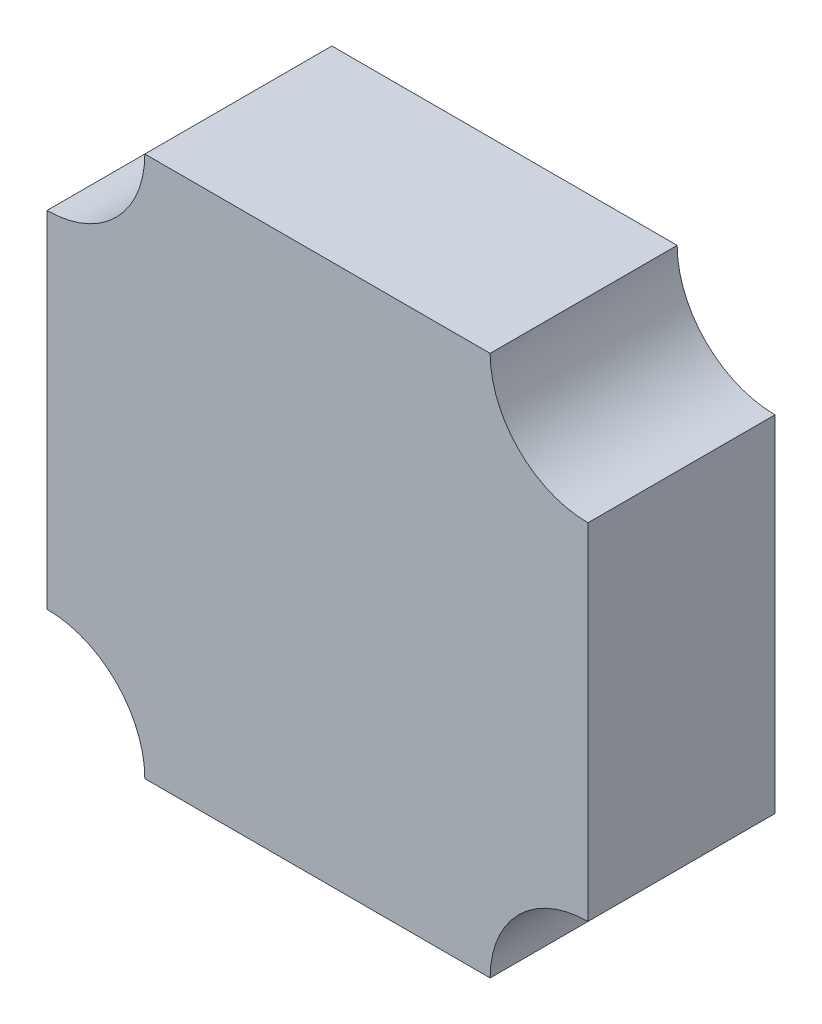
ISO-10303-21;
HEADER;
FILE_DESCRIPTION(('STEP AP214'),'2;1');
FILE_NAME('part.step','',(''),(''),'','','');
FILE_SCHEMA(('AUTOMOTIVE_DESIGN { 1 0 10303 214 1 1 1 1 }'));
ENDSEC;
DATA;
#1=APPLICATION_CONTEXT('core data for automotive mechanical design processes');
#2=APPLICATION_PROTOCOL_DEFINITION('international standard','automotive_design',2000,#1);
#3=PRODUCT_CONTEXT('',#1,'mechanical');
#4=PRODUCT('Part','Part','',(#3));
#5=PRODUCT_RELATED_PRODUCT_CATEGORY('part','',(#4));
#6=PRODUCT_DEFINITION_FORMATION('','',#4);
#7=PRODUCT_DEFINITION_CONTEXT('part definition',#1,'design');
#8=PRODUCT_DEFINITION('design','',#6,#7);
#9=PRODUCT_DEFINITION_SHAPE('','',#8);
#10=(LENGTH_UNIT() NAMED_UNIT(*) SI_UNIT(.MILLI.,.METRE.));
#11=(NAMED_UNIT(*) PLANE_ANGLE_UNIT() SI_UNIT($,.RADIAN.));
#12=(NAMED_UNIT(*) SI_UNIT($,.STERADIAN.) SOLID_ANGLE_UNIT());
#13=UNCERTAINTY_MEASURE_WITH_UNIT(LENGTH_MEASURE(1.E-05),#10,'distance_accuracy_value','');
#14=(GEOMETRIC_REPRESENTATION_CONTEXT(3) GLOBAL_UNCERTAINTY_ASSIGNED_CONTEXT((#13)) GLOBAL_UNIT_ASSIGNED_CONTEXT((#10,
#11,#12)) REPRESENTATION_CONTEXT('',''));
#15=CARTESIAN_POINT('',(0.,0.,0.));
#16=DIRECTION('',(0.,0.,1.));
#17=DIRECTION('',(1.,0.,0.));
#18=AXIS2_PLACEMENT_3D('',#15,#16,#17);
#19=CARTESIAN_POINT('',(-28.2,28.2,19.5));
#20=DIRECTION('',(0.,0.,-1.));
#21=DIRECTION('',(-1.,0.,0.));
#22=AXIS2_PLACEMENT_3D('',#19,#20,#21);
#23=CYLINDRICAL_SURFACE('',#22,10.2);
#24=CARTESIAN_POINT('',(-28.2,28.2,0.));
#25=DIRECTION('',(0.,0.,-1.));
#26=DIRECTION('',(1.,0.,0.));
#27=AXIS2_PLACEMENT_3D('',#24,#25,#26);
#28=CIRCLE('',#27,10.2);
#29=CARTESIAN_POINT('',(-18.,28.2,0.));
#30=VERTEX_POINT('',#29);
#31=CARTESIAN_POINT('',(-28.2,18.,0.));
#32=VERTEX_POINT('',#31);
#33=EDGE_CURVE('E129',#30,#32,#28,.T.);
#34=ORIENTED_EDGE('',*,*,#33,.T.);
#35=DIRECTION('',(0.,0.,-1.));
#36=VECTOR('',#35,1.);
#37=CARTESIAN_POINT('',(-28.2,18.,19.5));
#38=LINE('',#37,#36);
#39=CARTESIAN_POINT('',(-28.2,18.,19.5));
#40=VERTEX_POINT('',#39);
#41=EDGE_CURVE('E11',#40,#32,#38,.T.);
#42=ORIENTED_EDGE('',*,*,#41,.F.);
#43=CARTESIAN_POINT('',(-28.2,28.2,19.5));
#44=DIRECTION('',(0.,0.,-1.));
#45=DIRECTION('',(1.,0.,0.));
#46=AXIS2_PLACEMENT_3D('',#43,#44,#45);
#47=CIRCLE('',#46,10.2);
#48=CARTESIAN_POINT('',(-18.,28.2,19.5));
#49=VERTEX_POINT('',#48);
#50=EDGE_CURVE('E143',#49,#40,#47,.T.);
#51=ORIENTED_EDGE('',*,*,#50,.F.);
#52=DIRECTION('',(0.,0.,-1.));
#53=VECTOR('',#52,1.);
#54=CARTESIAN_POINT('',(-18.,28.2,19.5));
#55=LINE('',#54,#53);
#56=EDGE_CURVE('E125',#49,#30,#55,.T.);
#57=ORIENTED_EDGE('',*,*,#56,.T.);
#58=EDGE_LOOP('',(#34,#42,#51,#57));
#59=FACE_BOUND('',#58,.T.);
#60=ADVANCED_FACE('F33',(#59),#23,.F.);
#61=CARTESIAN_POINT('',(-28.2,-18.,19.5));
#62=DIRECTION('',(1.,0.,0.));
#63=DIRECTION('',(0.,0.,-1.));
#64=AXIS2_PLACEMENT_3D('',#61,#62,#63);
#65=PLANE('',#64);
#66=DIRECTION('',(0.,-1.,0.));
#67=VECTOR('',#66,1.);
#68=CARTESIAN_POINT('',(-28.2,-18.,0.));
#69=LINE('',#68,#67);
#70=CARTESIAN_POINT('',(-28.2,-18.,0.));
#71=VERTEX_POINT('',#70);
#72=EDGE_CURVE('E132',#32,#71,#69,.T.);
#73=ORIENTED_EDGE('',*,*,#72,.T.);
#74=DIRECTION('',(0.,0.,-1.));
#75=VECTOR('',#74,1.);
#76=CARTESIAN_POINT('',(-28.2,-18.,19.5));
#77=LINE('',#76,#75);
#78=CARTESIAN_POINT('',(-28.2,-18.,19.5));
#79=VERTEX_POINT('',#78);
#80=EDGE_CURVE('E41',#79,#71,#77,.T.);
#81=ORIENTED_EDGE('',*,*,#80,.F.);
#82=DIRECTION('',(0.,-1.,0.));
#83=VECTOR('',#82,1.);
#84=CARTESIAN_POINT('',(-28.2,-18.,19.5));
#85=LINE('',#84,#83);
#86=EDGE_CURVE('E92',#40,#79,#85,.T.);
#87=ORIENTED_EDGE('',*,*,#86,.F.);
#88=ORIENTED_EDGE('',*,*,#41,.T.);
#89=EDGE_LOOP('',(#73,#81,#87,#88));
#90=FACE_BOUND('',#89,.T.);
#91=ADVANCED_FACE('F178',(#90),#65,.F.);
#92=CARTESIAN_POINT('',(-28.2,-28.2,19.5));
#93=DIRECTION('',(0.,0.,-1.));
#94=DIRECTION('',(-1.,0.,0.));
#95=AXIS2_PLACEMENT_3D('',#92,#93,#94);
#96=CYLINDRICAL_SURFACE('',#95,10.2);
#97=CARTESIAN_POINT('',(-28.2,-28.2,0.));
#98=DIRECTION('',(0.,0.,-1.));
#99=DIRECTION('',(-1.,0.,0.));
#100=AXIS2_PLACEMENT_3D('',#97,#98,#99);
#101=CIRCLE('',#100,10.2);
#102=CARTESIAN_POINT('',(-18.,-28.2,0.));
#103=VERTEX_POINT('',#102);
#104=EDGE_CURVE('E134',#71,#103,#101,.T.);
#105=ORIENTED_EDGE('',*,*,#104,.T.);
#106=DIRECTION('',(0.,0.,-1.));
#107=VECTOR('',#106,1.);
#108=CARTESIAN_POINT('',(-18.,-28.2,19.5));
#109=LINE('',#108,#107);
#110=CARTESIAN_POINT('',(-18.,-28.2,19.5));
#111=VERTEX_POINT('',#110);
#112=EDGE_CURVE('E150',#111,#103,#109,.T.);
#113=ORIENTED_EDGE('',*,*,#112,.F.);
#114=CARTESIAN_POINT('',(-28.2,-28.2,19.5));
#115=DIRECTION('',(0.,0.,-1.));
#116=DIRECTION('',(-1.,0.,0.));
#117=AXIS2_PLACEMENT_3D('',#114,#115,#116);
#118=CIRCLE('',#117,10.2);
#119=EDGE_CURVE('E158',#79,#111,#118,.T.);
#120=ORIENTED_EDGE('',*,*,#119,.F.);
#121=ORIENTED_EDGE('',*,*,#80,.T.);
#122=EDGE_LOOP('',(#105,#113,#120,#121));
#123=FACE_BOUND('',#122,.T.);
#124=ADVANCED_FACE('F156',(#123),#96,.F.);
#125=CARTESIAN_POINT('',(18.,-28.2,19.5));
#126=DIRECTION('',(0.,1.,0.));
#127=DIRECTION('',(0.,0.,1.));
#128=AXIS2_PLACEMENT_3D('',#125,#126,#127);
#129=PLANE('',#128);
#130=DIRECTION('',(1.,0.,0.));
#131=VECTOR('',#130,1.);
#132=CARTESIAN_POINT('',(18.,-28.2,0.));
#133=LINE('',#132,#131);
#134=CARTESIAN_POINT('',(18.,-28.2,0.));
#135=VERTEX_POINT('',#134);
#136=EDGE_CURVE('E136',#103,#135,#133,.T.);
#137=ORIENTED_EDGE('',*,*,#136,.T.);
#138=DIRECTION('',(0.,0.,-1.));
#139=VECTOR('',#138,1.);
#140=CARTESIAN_POINT('',(18.,-28.2,19.5));
#141=LINE('',#140,#139);
#142=CARTESIAN_POINT('',(18.,-28.2,19.5));
#143=VERTEX_POINT('',#142);
#144=EDGE_CURVE('E147',#143,#135,#141,.T.);
#145=ORIENTED_EDGE('',*,*,#144,.F.);
#146=DIRECTION('',(1.,0.,0.));
#147=VECTOR('',#146,1.);
#148=CARTESIAN_POINT('',(18.,-28.2,19.5));
#149=LINE('',#148,#147);
#150=EDGE_CURVE('E170',#111,#143,#149,.T.);
#151=ORIENTED_EDGE('',*,*,#150,.F.);
#152=ORIENTED_EDGE('',*,*,#112,.T.);
#153=EDGE_LOOP('',(#137,#145,#151,#152));
#154=FACE_BOUND('',#153,.T.);
#155=ADVANCED_FACE('F166',(#154),#129,.F.);
#156=CARTESIAN_POINT('',(28.2,-28.2,19.5));
#157=DIRECTION('',(0.,0.,-1.));
#158=DIRECTION('',(-1.,0.,0.));
#159=AXIS2_PLACEMENT_3D('',#156,#157,#158);
#160=CYLINDRICAL_SURFACE('',#159,10.2);
#161=CARTESIAN_POINT('',(28.2,-28.2,0.));
#162=DIRECTION('',(0.,0.,-1.));
#163=DIRECTION('',(1.,0.,0.));
#164=AXIS2_PLACEMENT_3D('',#161,#162,#163);
#165=CIRCLE('',#164,10.2);
#166=CARTESIAN_POINT('',(28.2,-18.,0.));
#167=VERTEX_POINT('',#166);
#168=EDGE_CURVE('E138',#135,#167,#165,.T.);
#169=ORIENTED_EDGE('',*,*,#168,.T.);
#170=DIRECTION('',(0.,0.,-1.));
#171=VECTOR('',#170,1.);
#172=CARTESIAN_POINT('',(28.2,-18.,19.5));
#173=LINE('',#172,#171);
#174=CARTESIAN_POINT('',(28.2,-18.,19.5));
#175=VERTEX_POINT('',#174);
#176=EDGE_CURVE('E120',#175,#167,#173,.T.);
#177=ORIENTED_EDGE('',*,*,#176,.F.);
#178=CARTESIAN_POINT('',(28.2,-28.2,19.5));
#179=DIRECTION('',(0.,0.,-1.));
#180=DIRECTION('',(1.,0.,0.));
#181=AXIS2_PLACEMENT_3D('',#178,#179,#180);
#182=CIRCLE('',#181,10.2);
#183=EDGE_CURVE('E111',#143,#175,#182,.T.);
#184=ORIENTED_EDGE('',*,*,#183,.F.);
#185=ORIENTED_EDGE('',*,*,#144,.T.);
#186=EDGE_LOOP('',(#169,#177,#184,#185));
#187=FACE_BOUND('',#186,.T.);
#188=ADVANCED_FACE('F169',(#187),#160,.F.);
#189=CARTESIAN_POINT('',(28.2,-18.,19.5));
#190=DIRECTION('',(-1.,0.,0.));
#191=DIRECTION('',(0.,0.,1.));
#192=AXIS2_PLACEMENT_3D('',#189,#190,#191);
#193=PLANE('',#192);
#194=DIRECTION('',(0.,1.,0.));
#195=VECTOR('',#194,1.);
#196=CARTESIAN_POINT('',(28.2,-18.,0.));
#197=LINE('',#196,#195);
#198=CARTESIAN_POINT('',(28.2,18.,0.));
#199=VERTEX_POINT('',#198);
#200=EDGE_CURVE('E119',#167,#199,#197,.T.);
#201=ORIENTED_EDGE('',*,*,#200,.T.);
#202=DIRECTION('',(0.,0.,-1.));
#203=VECTOR('',#202,1.);
#204=CARTESIAN_POINT('',(28.2,18.,19.5));
#205=LINE('',#204,#203);
#206=CARTESIAN_POINT('',(28.2,18.,19.5));
#207=VERTEX_POINT('',#206);
#208=EDGE_CURVE('E116',#207,#199,#205,.T.);
#209=ORIENTED_EDGE('',*,*,#208,.F.);
#210=DIRECTION('',(0.,1.,0.));
#211=VECTOR('',#210,1.);
#212=CARTESIAN_POINT('',(28.2,-18.,19.5));
#213=LINE('',#212,#211);
#214=EDGE_CURVE('E105',#175,#207,#213,.T.);
#215=ORIENTED_EDGE('',*,*,#214,.F.);
#216=ORIENTED_EDGE('',*,*,#176,.T.);
#217=EDGE_LOOP('',(#201,#209,#215,#216));
#218=FACE_BOUND('',#217,.T.);
#219=ADVANCED_FACE('F117',(#218),#193,.F.);
#220=CARTESIAN_POINT('',(28.2,28.2,19.5));
#221=DIRECTION('',(0.,0.,-1.));
#222=DIRECTION('',(-1.,0.,0.));
#223=AXIS2_PLACEMENT_3D('',#220,#221,#222);
#224=CYLINDRICAL_SURFACE('',#223,10.2);
#225=CARTESIAN_POINT('',(28.2,28.2,0.));
#226=DIRECTION('',(0.,0.,-1.));
#227=DIRECTION('',(1.,0.,0.));
#228=AXIS2_PLACEMENT_3D('',#225,#226,#227);
#229=CIRCLE('',#228,10.2);
#230=CARTESIAN_POINT('',(18.,28.2,0.));
#231=VERTEX_POINT('',#230);
#232=EDGE_CURVE('E78',#199,#231,#229,.T.);
#233=ORIENTED_EDGE('',*,*,#232,.T.);
#234=DIRECTION('',(0.,0.,-1.));
#235=VECTOR('',#234,1.);
#236=CARTESIAN_POINT('',(18.,28.2,19.5));
#237=LINE('',#236,#235);
#238=CARTESIAN_POINT('',(18.,28.2,19.5));
#239=VERTEX_POINT('',#238);
#240=EDGE_CURVE('E121',#239,#231,#237,.T.);
#241=ORIENTED_EDGE('',*,*,#240,.F.);
#242=CARTESIAN_POINT('',(28.2,28.2,19.5));
#243=DIRECTION('',(0.,0.,-1.));
#244=DIRECTION('',(1.,0.,0.));
#245=AXIS2_PLACEMENT_3D('',#242,#243,#244);
#246=CIRCLE('',#245,10.2);
#247=EDGE_CURVE('E109',#207,#239,#246,.T.);
#248=ORIENTED_EDGE('',*,*,#247,.F.);
#249=ORIENTED_EDGE('',*,*,#208,.T.);
#250=EDGE_LOOP('',(#233,#241,#248,#249));
#251=FACE_BOUND('',#250,.T.);
#252=ADVANCED_FACE('F123',(#251),#224,.F.);
#253=CARTESIAN_POINT('',(18.,28.2,19.5));
#254=DIRECTION('',(0.,-1.,0.));
#255=DIRECTION('',(0.,0.,-1.));
#256=AXIS2_PLACEMENT_3D('',#253,#254,#255);
#257=PLANE('',#256);
#258=DIRECTION('',(-1.,0.,0.));
#259=VECTOR('',#258,1.);
#260=CARTESIAN_POINT('',(18.,28.2,0.));
#261=LINE('',#260,#259);
#262=EDGE_CURVE('E84',#231,#30,#261,.T.);
#263=ORIENTED_EDGE('',*,*,#262,.T.);
#264=ORIENTED_EDGE('',*,*,#56,.F.);
#265=DIRECTION('',(-1.,0.,0.));
#266=VECTOR('',#265,1.);
#267=CARTESIAN_POINT('',(18.,28.2,19.5));
#268=LINE('',#267,#266);
#269=EDGE_CURVE('E49',#239,#49,#268,.T.);
#270=ORIENTED_EDGE('',*,*,#269,.F.);
#271=ORIENTED_EDGE('',*,*,#240,.T.);
#272=EDGE_LOOP('',(#263,#264,#270,#271));
#273=FACE_BOUND('',#272,.T.);
#274=ADVANCED_FACE('F194',(#273),#257,.F.);
#275=CARTESIAN_POINT('',(-28.2,28.2,19.5));
#276=DIRECTION('',(0.,0.,1.));
#277=DIRECTION('',(1.,0.,0.));
#278=AXIS2_PLACEMENT_3D('',#275,#276,#277);
#279=PLANE('',#278);
#280=ORIENTED_EDGE('',*,*,#50,.T.);
#281=ORIENTED_EDGE('',*,*,#86,.T.);
#282=ORIENTED_EDGE('',*,*,#119,.T.);
#283=ORIENTED_EDGE('',*,*,#150,.T.);
#284=ORIENTED_EDGE('',*,*,#183,.T.);
#285=ORIENTED_EDGE('',*,*,#214,.T.);
#286=ORIENTED_EDGE('',*,*,#247,.T.);
#287=ORIENTED_EDGE('',*,*,#269,.T.);
#288=EDGE_LOOP('',(#280,#281,#282,#283,#284,#285,#286,#287));
#289=FACE_BOUND('',#288,.T.);
#290=ADVANCED_FACE('F107',(#289),#279,.T.);
#291=CARTESIAN_POINT('',(-28.2,28.2,0.));
#292=DIRECTION('',(0.,0.,1.));
#293=DIRECTION('',(1.,0.,0.));
#294=AXIS2_PLACEMENT_3D('',#291,#292,#293);
#295=PLANE('',#294);
#296=ORIENTED_EDGE('',*,*,#33,.F.);
#297=ORIENTED_EDGE('',*,*,#262,.F.);
#298=ORIENTED_EDGE('',*,*,#232,.F.);
#299=ORIENTED_EDGE('',*,*,#200,.F.);
#300=ORIENTED_EDGE('',*,*,#168,.F.);
#301=ORIENTED_EDGE('',*,*,#136,.F.);
#302=ORIENTED_EDGE('',*,*,#104,.F.);
#303=ORIENTED_EDGE('',*,*,#72,.F.);
#304=EDGE_LOOP('',(#296,#297,#298,#299,#300,#301,#302,#303));
#305=FACE_BOUND('',#304,.T.);
#306=ADVANCED_FACE('F162',(#305),#295,.F.);
#307=CLOSED_SHELL('',(#60,#91,#124,#155,#188,#219,#252,#274,#290,#306));
#308=MANIFOLD_SOLID_BREP('B2',#307);
#309=ADVANCED_BREP_SHAPE_REPRESENTATION('',(#18,#308),#14);
#310=SHAPE_DEFINITION_REPRESENTATION(#9,#309);
ENDSEC;
END-ISO-10303-21;
